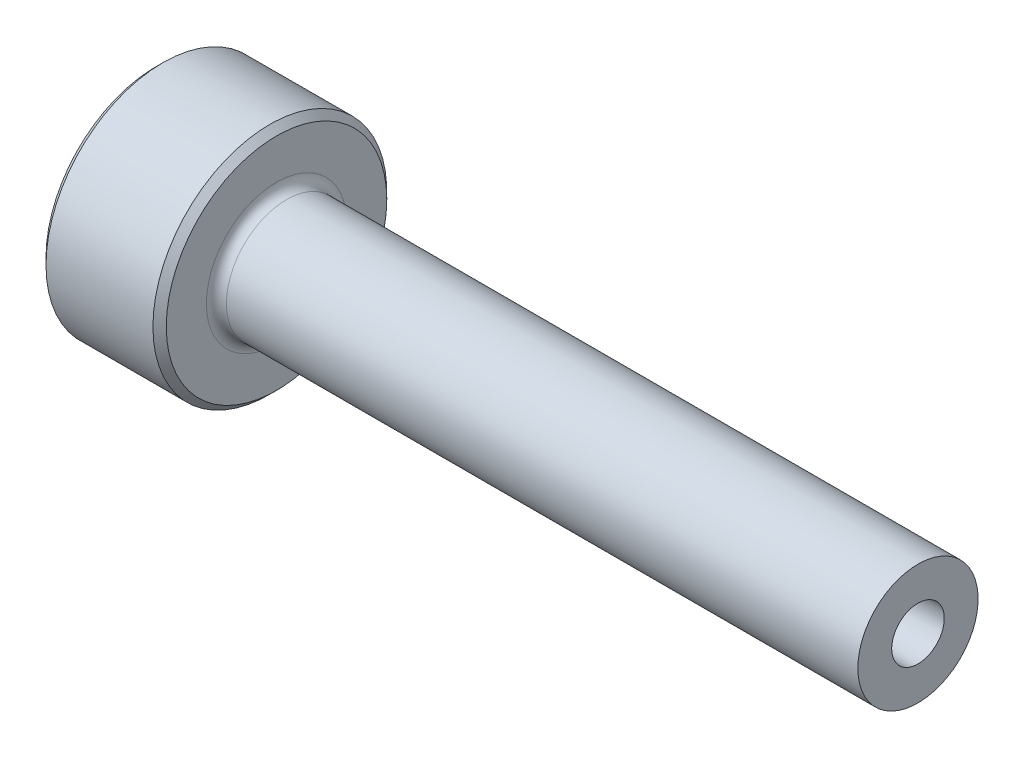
ISO-10303-21;
HEADER;
FILE_DESCRIPTION(('STEP AP214'),'2;1');
FILE_NAME('part.step','',(''),(''),'','','');
FILE_SCHEMA(('AUTOMOTIVE_DESIGN { 1 0 10303 214 1 1 1 1 }'));
ENDSEC;
DATA;
#1=APPLICATION_CONTEXT('core data for automotive mechanical design processes');
#2=APPLICATION_PROTOCOL_DEFINITION('international standard','automotive_design',2000,#1);
#3=PRODUCT_CONTEXT('',#1,'mechanical');
#4=PRODUCT('Part','Part','',(#3));
#5=PRODUCT_RELATED_PRODUCT_CATEGORY('part','',(#4));
#6=PRODUCT_DEFINITION_FORMATION('','',#4);
#7=PRODUCT_DEFINITION_CONTEXT('part definition',#1,'design');
#8=PRODUCT_DEFINITION('design','',#6,#7);
#9=PRODUCT_DEFINITION_SHAPE('','',#8);
#10=(LENGTH_UNIT() NAMED_UNIT(*) SI_UNIT(.MILLI.,.METRE.));
#11=(NAMED_UNIT(*) PLANE_ANGLE_UNIT() SI_UNIT($,.RADIAN.));
#12=(NAMED_UNIT(*) SI_UNIT($,.STERADIAN.) SOLID_ANGLE_UNIT());
#13=UNCERTAINTY_MEASURE_WITH_UNIT(LENGTH_MEASURE(1.E-05),#10,'distance_accuracy_value','');
#14=(GEOMETRIC_REPRESENTATION_CONTEXT(3) GLOBAL_UNCERTAINTY_ASSIGNED_CONTEXT((#13)) GLOBAL_UNIT_ASSIGNED_CONTEXT((#10,
#11,#12)) REPRESENTATION_CONTEXT('',''));
#15=CARTESIAN_POINT('',(0.,0.,0.));
#16=DIRECTION('',(0.,0.,1.));
#17=DIRECTION('',(1.,0.,0.));
#18=AXIS2_PLACEMENT_3D('',#15,#16,#17);
#19=CARTESIAN_POINT('',(0.,4.10062261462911,0.));
#20=DIRECTION('',(1.,0.,0.));
#21=DIRECTION('',(0.,0.,-1.));
#22=AXIS2_PLACEMENT_3D('',#19,#20,#21);
#23=PLANE('',#22);
#24=CARTESIAN_POINT('',(0.,0.,0.));
#25=DIRECTION('',(1.,0.,0.));
#26=DIRECTION('',(0.,0.,-1.));
#27=AXIS2_PLACEMENT_3D('',#24,#25,#26);
#28=CIRCLE('',#27,16.5);
#29=CARTESIAN_POINT('',(0.,0.,-16.5));
#30=VERTEX_POINT('',#29);
#31=EDGE_CURVE('E9',#30,#30,#28,.F.);
#32=ORIENTED_EDGE('',*,*,#31,.T.);
#33=EDGE_LOOP('',(#32));
#34=FACE_BOUND('',#33,.T.);
#35=CARTESIAN_POINT('',(0.,0.,0.));
#36=DIRECTION('',(-1.,0.,0.));
#37=DIRECTION('',(0.,0.,1.));
#38=AXIS2_PLACEMENT_3D('',#35,#36,#37);
#39=CIRCLE('',#38,4.10062261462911);
#40=CARTESIAN_POINT('',(0.,0.,4.10062261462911));
#41=VERTEX_POINT('',#40);
#42=EDGE_CURVE('E49',#41,#41,#39,.T.);
#43=ORIENTED_EDGE('',*,*,#42,.F.);
#44=EDGE_LOOP('',(#43));
#45=FACE_BOUND('',#44,.T.);
#46=ADVANCED_FACE('F14',(#34,#45),#23,.F.);
#47=CARTESIAN_POINT('',(0.,0.,0.));
#48=DIRECTION('',(-1.,0.,0.));
#49=DIRECTION('',(0.,0.,1.));
#50=AXIS2_PLACEMENT_3D('',#47,#48,#49);
#51=CYLINDRICAL_SURFACE('',#50,17.5);
#52=CARTESIAN_POINT('',(17.,0.,0.));
#53=DIRECTION('',(-1.,0.,0.));
#54=DIRECTION('',(0.,0.,1.));
#55=AXIS2_PLACEMENT_3D('',#52,#53,#54);
#56=CIRCLE('',#55,17.5);
#57=CARTESIAN_POINT('',(17.,0.,17.5));
#58=VERTEX_POINT('',#57);
#59=EDGE_CURVE('E25',#58,#58,#56,.T.);
#60=ORIENTED_EDGE('',*,*,#59,.T.);
#61=EDGE_LOOP('',(#60));
#62=FACE_BOUND('',#61,.T.);
#63=CARTESIAN_POINT('',(1.,0.,0.));
#64=DIRECTION('',(1.,0.,0.));
#65=DIRECTION('',(0.,0.,-1.));
#66=AXIS2_PLACEMENT_3D('',#63,#64,#65);
#67=CIRCLE('',#66,17.5);
#68=CARTESIAN_POINT('',(1.,0.,-17.5));
#69=VERTEX_POINT('',#68);
#70=EDGE_CURVE('E29',#69,#69,#67,.T.);
#71=ORIENTED_EDGE('',*,*,#70,.T.);
#72=EDGE_LOOP('',(#71));
#73=FACE_BOUND('',#72,.T.);
#74=ADVANCED_FACE('F56',(#62,#73),#51,.T.);
#75=CARTESIAN_POINT('',(18.,17.5,0.));
#76=DIRECTION('',(-1.,0.,0.));
#77=DIRECTION('',(0.,0.,1.));
#78=AXIS2_PLACEMENT_3D('',#75,#76,#77);
#79=PLANE('',#78);
#80=CARTESIAN_POINT('',(18.,0.,0.));
#81=DIRECTION('',(-1.,0.,0.));
#82=DIRECTION('',(0.,0.,1.));
#83=AXIS2_PLACEMENT_3D('',#80,#81,#82);
#84=CIRCLE('',#83,16.5);
#85=CARTESIAN_POINT('',(18.,0.,16.5));
#86=VERTEX_POINT('',#85);
#87=EDGE_CURVE('E21',#86,#86,#84,.F.);
#88=ORIENTED_EDGE('',*,*,#87,.T.);
#89=EDGE_LOOP('',(#88));
#90=FACE_BOUND('',#89,.T.);
#91=CARTESIAN_POINT('',(18.,0.,0.));
#92=DIRECTION('',(-1.,0.,0.));
#93=DIRECTION('',(0.,0.,1.));
#94=AXIS2_PLACEMENT_3D('',#91,#92,#93);
#95=CIRCLE('',#94,10.5);
#96=CARTESIAN_POINT('',(18.,0.,10.5));
#97=VERTEX_POINT('',#96);
#98=EDGE_CURVE('E34',#97,#97,#95,.T.);
#99=ORIENTED_EDGE('',*,*,#98,.T.);
#100=EDGE_LOOP('',(#99));
#101=FACE_BOUND('',#100,.T.);
#102=ADVANCED_FACE('F63',(#90,#101),#79,.F.);
#103=CARTESIAN_POINT('',(19.5,0.,0.));
#104=DIRECTION('',(-1.,0.,0.));
#105=DIRECTION('',(0.,0.,1.));
#106=AXIS2_PLACEMENT_3D('',#103,#104,#105);
#107=TOROIDAL_SURFACE('',#106,10.5,1.5);
#108=ORIENTED_EDGE('',*,*,#98,.F.);
#109=EDGE_LOOP('',(#108));
#110=FACE_BOUND('',#109,.T.);
#111=CARTESIAN_POINT('',(19.5,0.,0.));
#112=DIRECTION('',(-1.,0.,0.));
#113=DIRECTION('',(0.,0.,1.));
#114=AXIS2_PLACEMENT_3D('',#111,#112,#113);
#115=CIRCLE('',#114,9.);
#116=CARTESIAN_POINT('',(19.5,0.,9.));
#117=VERTEX_POINT('',#116);
#118=EDGE_CURVE('E37',#117,#117,#115,.T.);
#119=ORIENTED_EDGE('',*,*,#118,.T.);
#120=EDGE_LOOP('',(#119));
#121=FACE_BOUND('',#120,.T.);
#122=ADVANCED_FACE('F99',(#110,#121),#107,.F.);
#123=CARTESIAN_POINT('',(0.,0.,0.));
#124=DIRECTION('',(-1.,0.,0.));
#125=DIRECTION('',(0.,0.,1.));
#126=AXIS2_PLACEMENT_3D('',#123,#124,#125);
#127=CYLINDRICAL_SURFACE('',#126,9.);
#128=ORIENTED_EDGE('',*,*,#118,.F.);
#129=EDGE_LOOP('',(#128));
#130=FACE_BOUND('',#129,.T.);
#131=CARTESIAN_POINT('',(114.,0.,0.));
#132=DIRECTION('',(-1.,0.,0.));
#133=DIRECTION('',(0.,0.,1.));
#134=AXIS2_PLACEMENT_3D('',#131,#132,#133);
#135=CIRCLE('',#134,9.);
#136=CARTESIAN_POINT('',(114.,0.,9.));
#137=VERTEX_POINT('',#136);
#138=EDGE_CURVE('E40',#137,#137,#135,.T.);
#139=ORIENTED_EDGE('',*,*,#138,.T.);
#140=EDGE_LOOP('',(#139));
#141=FACE_BOUND('',#140,.T.);
#142=ADVANCED_FACE('F95',(#130,#141),#127,.T.);
#143=CARTESIAN_POINT('',(114.,3.93751220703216,0.));
#144=DIRECTION('',(-1.,0.,0.));
#145=DIRECTION('',(0.,0.,1.));
#146=AXIS2_PLACEMENT_3D('',#143,#144,#145);
#147=PLANE('',#146);
#148=ORIENTED_EDGE('',*,*,#138,.F.);
#149=EDGE_LOOP('',(#148));
#150=FACE_BOUND('',#149,.T.);
#151=CARTESIAN_POINT('',(114.,0.,0.));
#152=DIRECTION('',(-1.,0.,0.));
#153=DIRECTION('',(0.,0.,1.));
#154=AXIS2_PLACEMENT_3D('',#151,#152,#153);
#155=CIRCLE('',#154,3.93751220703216);
#156=CARTESIAN_POINT('',(114.,0.,3.93751220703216));
#157=VERTEX_POINT('',#156);
#158=EDGE_CURVE('E43',#157,#157,#155,.T.);
#159=ORIENTED_EDGE('',*,*,#158,.T.);
#160=EDGE_LOOP('',(#159));
#161=FACE_BOUND('',#160,.T.);
#162=ADVANCED_FACE('F88',(#150,#161),#147,.F.);
#163=CARTESIAN_POINT('',(3.,0.,0.));
#164=DIRECTION('',(1.,0.,0.));
#165=DIRECTION('',(0.,0.,-1.));
#166=AXIS2_PLACEMENT_3D('',#163,#164,#165);
#167=CONICAL_SURFACE('',#166,2.,0.0174532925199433);
#168=ORIENTED_EDGE('',*,*,#158,.F.);
#169=EDGE_LOOP('',(#168));
#170=FACE_BOUND('',#169,.T.);
#171=CARTESIAN_POINT('',(3.,0.,0.));
#172=DIRECTION('',(-1.,0.,0.));
#173=DIRECTION('',(0.,0.,1.));
#174=AXIS2_PLACEMENT_3D('',#171,#172,#173);
#175=CIRCLE('',#174,2.);
#176=CARTESIAN_POINT('',(3.,0.,2.));
#177=VERTEX_POINT('',#176);
#178=EDGE_CURVE('E46',#177,#177,#175,.T.);
#179=ORIENTED_EDGE('',*,*,#178,.T.);
#180=EDGE_LOOP('',(#179));
#181=FACE_BOUND('',#180,.T.);
#182=ADVANCED_FACE('F76',(#170,#181),#167,.F.);
#183=CARTESIAN_POINT('',(0.,0.,0.));
#184=DIRECTION('',(-1.,0.,0.));
#185=DIRECTION('',(0.,0.,1.));
#186=AXIS2_PLACEMENT_3D('',#183,#184,#185);
#187=CONICAL_SURFACE('',#186,4.10062261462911,0.61086523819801);
#188=ORIENTED_EDGE('',*,*,#178,.F.);
#189=EDGE_LOOP('',(#188));
#190=FACE_BOUND('',#189,.T.);
#191=ORIENTED_EDGE('',*,*,#42,.T.);
#192=EDGE_LOOP('',(#191));
#193=FACE_BOUND('',#192,.T.);
#194=ADVANCED_FACE('F53',(#190,#193),#187,.F.);
#195=CARTESIAN_POINT('',(17.,0.,0.));
#196=DIRECTION('',(-1.,0.,0.));
#197=DIRECTION('',(0.,0.,1.));
#198=AXIS2_PLACEMENT_3D('',#195,#196,#197);
#199=CONICAL_SURFACE('',#198,17.5,0.785398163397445);
#200=ORIENTED_EDGE('',*,*,#87,.F.);
#201=EDGE_LOOP('',(#200));
#202=FACE_BOUND('',#201,.T.);
#203=ORIENTED_EDGE('',*,*,#59,.F.);
#204=EDGE_LOOP('',(#203));
#205=FACE_BOUND('',#204,.T.);
#206=ADVANCED_FACE('F67',(#202,#205),#199,.T.);
#207=CARTESIAN_POINT('',(0.,0.,0.));
#208=DIRECTION('',(1.,0.,0.));
#209=DIRECTION('',(0.,0.,-1.));
#210=AXIS2_PLACEMENT_3D('',#207,#208,#209);
#211=CONICAL_SURFACE('',#210,16.5,0.785398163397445);
#212=ORIENTED_EDGE('',*,*,#70,.F.);
#213=EDGE_LOOP('',(#212));
#214=FACE_BOUND('',#213,.T.);
#215=ORIENTED_EDGE('',*,*,#31,.F.);
#216=EDGE_LOOP('',(#215));
#217=FACE_BOUND('',#216,.T.);
#218=ADVANCED_FACE('F16',(#214,#217),#211,.T.);
#219=CLOSED_SHELL('',(#46,#74,#102,#122,#142,#162,#182,#194,#206,#218));
#220=MANIFOLD_SOLID_BREP('B1',#219);
#221=ADVANCED_BREP_SHAPE_REPRESENTATION('',(#18,#220),#14);
#222=SHAPE_DEFINITION_REPRESENTATION(#9,#221);
ENDSEC;
END-ISO-10303-21;
